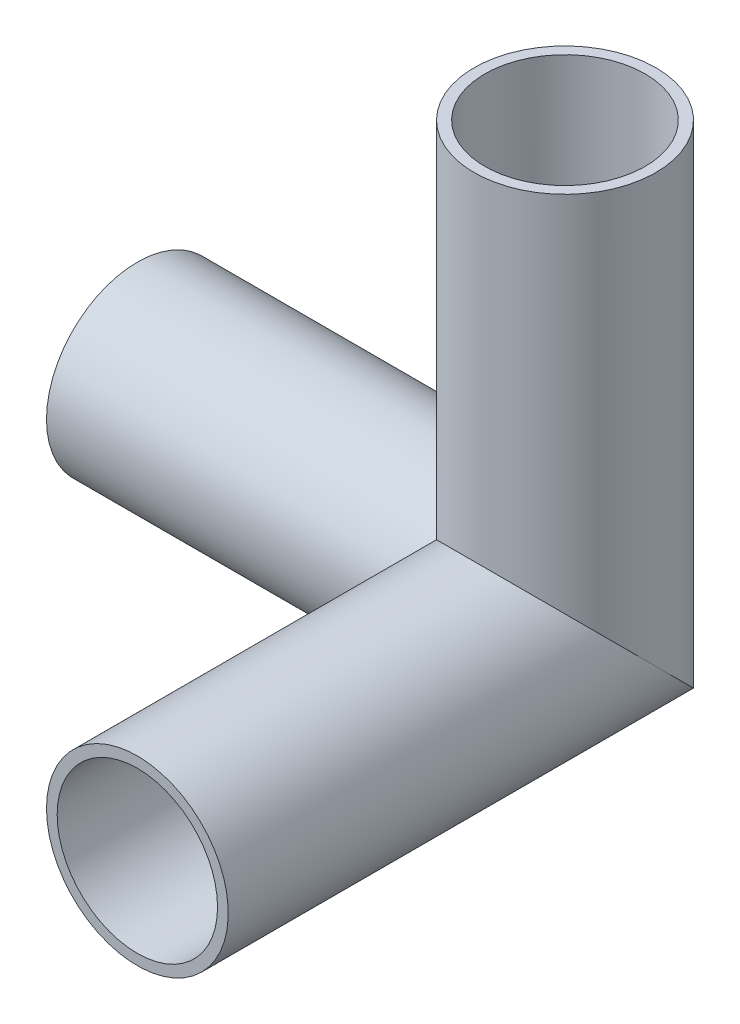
ISO-10303-21;
HEADER;
FILE_DESCRIPTION(('STEP AP214'),'2;1');
FILE_NAME('part.step','',(''),(''),'','','');
FILE_SCHEMA(('AUTOMOTIVE_DESIGN { 1 0 10303 214 1 1 1 1 }'));
ENDSEC;
DATA;
#1=APPLICATION_CONTEXT('core data for automotive mechanical design processes');
#2=APPLICATION_PROTOCOL_DEFINITION('international standard','automotive_design',2000,#1);
#3=PRODUCT_CONTEXT('',#1,'mechanical');
#4=PRODUCT('Part','Part','',(#3));
#5=PRODUCT_RELATED_PRODUCT_CATEGORY('part','',(#4));
#6=PRODUCT_DEFINITION_FORMATION('','',#4);
#7=PRODUCT_DEFINITION_CONTEXT('part definition',#1,'design');
#8=PRODUCT_DEFINITION('design','',#6,#7);
#9=PRODUCT_DEFINITION_SHAPE('','',#8);
#10=(LENGTH_UNIT() NAMED_UNIT(*) SI_UNIT(.MILLI.,.METRE.));
#11=(NAMED_UNIT(*) PLANE_ANGLE_UNIT() SI_UNIT($,.RADIAN.));
#12=(NAMED_UNIT(*) SI_UNIT($,.STERADIAN.) SOLID_ANGLE_UNIT());
#13=UNCERTAINTY_MEASURE_WITH_UNIT(LENGTH_MEASURE(1.E-05),#10,'distance_accuracy_value','');
#14=(GEOMETRIC_REPRESENTATION_CONTEXT(3) GLOBAL_UNCERTAINTY_ASSIGNED_CONTEXT((#13)) GLOBAL_UNIT_ASSIGNED_CONTEXT((#10,
#11,#12)) REPRESENTATION_CONTEXT('',''));
#15=CARTESIAN_POINT('',(0.,0.,0.));
#16=DIRECTION('',(0.,0.,1.));
#17=DIRECTION('',(1.,0.,0.));
#18=AXIS2_PLACEMENT_3D('',#15,#16,#17);
#19=CARTESIAN_POINT('',(0.,0.,-11.9745));
#20=DIRECTION('',(0.,0.,1.));
#21=DIRECTION('',(1.,0.,0.));
#22=AXIS2_PLACEMENT_3D('',#19,#20,#21);
#23=CYLINDRICAL_SURFACE('',#22,10.795);
#24=CARTESIAN_POINT('',(0.,0.,50.8));
#25=DIRECTION('',(0.,0.,-1.));
#26=DIRECTION('',(-1.,0.,0.));
#27=AXIS2_PLACEMENT_3D('',#24,#25,#26);
#28=CIRCLE('',#27,10.795);
#29=CARTESIAN_POINT('',(-10.795,0.,50.8));
#30=VERTEX_POINT('',#29);
#31=EDGE_CURVE('E111',#30,#30,#28,.T.);
#32=ORIENTED_EDGE('',*,*,#31,.T.);
#33=EDGE_LOOP('',(#32));
#34=FACE_BOUND('',#33,.T.);
#35=CARTESIAN_POINT('',(0.,0.,0.));
#36=DIRECTION('',(0.707106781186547,0.,0.707106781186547));
#37=DIRECTION('',(0.707106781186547,0.,-0.707106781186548));
#38=AXIS2_PLACEMENT_3D('',#35,#36,#37);
#39=ELLIPSE('',#38,15.2664354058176,10.795);
#40=CARTESIAN_POINT('',(-7.63321770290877,7.63321770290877,7.63321770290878));
#41=VERTEX_POINT('',#40);
#42=CARTESIAN_POINT('',(7.63321770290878,-7.63321770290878,-7.63321770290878));
#43=VERTEX_POINT('',#42);
#44=EDGE_CURVE('E49',#41,#43,#39,.T.);
#45=ORIENTED_EDGE('',*,*,#44,.T.);
#46=CARTESIAN_POINT('',(0.,0.,0.));
#47=DIRECTION('',(0.,-0.707106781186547,0.707106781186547));
#48=DIRECTION('',(0.,0.707106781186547,0.707106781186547));
#49=AXIS2_PLACEMENT_3D('',#46,#47,#48);
#50=ELLIPSE('',#49,15.2664354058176,10.795);
#51=EDGE_CURVE('E54',#41,#43,#50,.F.);
#52=ORIENTED_EDGE('',*,*,#51,.F.);
#53=EDGE_LOOP('',(#45,#52));
#54=FACE_BOUND('',#53,.T.);
#55=ADVANCED_FACE('F41',(#34,#54),#23,.T.);
#56=CARTESIAN_POINT('',(-50.8,0.,0.));
#57=DIRECTION('',(1.,0.,0.));
#58=DIRECTION('',(0.,0.,-1.));
#59=AXIS2_PLACEMENT_3D('',#56,#57,#58);
#60=CYLINDRICAL_SURFACE('',#59,10.795);
#61=CARTESIAN_POINT('',(-50.8,0.,0.));
#62=DIRECTION('',(-1.,0.,0.));
#63=DIRECTION('',(0.,0.,1.));
#64=AXIS2_PLACEMENT_3D('',#61,#62,#63);
#65=CIRCLE('',#64,10.795);
#66=CARTESIAN_POINT('',(-50.8,0.,10.795));
#67=VERTEX_POINT('',#66);
#68=EDGE_CURVE('E112',#67,#67,#65,.T.);
#69=ORIENTED_EDGE('',*,*,#68,.F.);
#70=EDGE_LOOP('',(#69));
#71=FACE_BOUND('',#70,.T.);
#72=CARTESIAN_POINT('',(0.,0.,0.));
#73=DIRECTION('',(0.707106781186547,0.707106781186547,0.));
#74=DIRECTION('',(0.707106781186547,-0.707106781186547,0.));
#75=AXIS2_PLACEMENT_3D('',#72,#73,#74);
#76=ELLIPSE('',#75,15.2664354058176,10.795);
#77=EDGE_CURVE('E11',#43,#41,#76,.T.);
#78=ORIENTED_EDGE('',*,*,#77,.F.);
#79=ORIENTED_EDGE('',*,*,#44,.F.);
#80=EDGE_LOOP('',(#78,#79));
#81=FACE_BOUND('',#80,.T.);
#82=ADVANCED_FACE('F122',(#71,#81),#60,.T.);
#83=CARTESIAN_POINT('',(0.,0.,50.8));
#84=DIRECTION('',(0.,0.,-1.));
#85=DIRECTION('',(-1.,0.,0.));
#86=AXIS2_PLACEMENT_3D('',#83,#84,#85);
#87=PLANE('',#86);
#88=CARTESIAN_POINT('',(0.,0.,50.8));
#89=DIRECTION('',(0.,0.,-1.));
#90=DIRECTION('',(-1.,0.,0.));
#91=AXIS2_PLACEMENT_3D('',#88,#89,#90);
#92=CIRCLE('',#91,9.525);
#93=CARTESIAN_POINT('',(-9.52499999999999,0.,50.8));
#94=VERTEX_POINT('',#93);
#95=EDGE_CURVE('E97',#94,#94,#92,.T.);
#96=ORIENTED_EDGE('',*,*,#95,.T.);
#97=EDGE_LOOP('',(#96));
#98=FACE_BOUND('',#97,.T.);
#99=ORIENTED_EDGE('',*,*,#31,.F.);
#100=EDGE_LOOP('',(#99));
#101=FACE_BOUND('',#100,.T.);
#102=ADVANCED_FACE('F119',(#98,#101),#87,.F.);
#103=CARTESIAN_POINT('',(-50.8,0.,0.));
#104=DIRECTION('',(-1.,0.,0.));
#105=DIRECTION('',(0.,0.,1.));
#106=AXIS2_PLACEMENT_3D('',#103,#104,#105);
#107=PLANE('',#106);
#108=CARTESIAN_POINT('',(-50.8,0.,0.));
#109=DIRECTION('',(-1.,0.,0.));
#110=DIRECTION('',(0.,0.,1.));
#111=AXIS2_PLACEMENT_3D('',#108,#109,#110);
#112=CIRCLE('',#111,9.525);
#113=CARTESIAN_POINT('',(-50.8,0.,9.525));
#114=VERTEX_POINT('',#113);
#115=EDGE_CURVE('E86',#114,#114,#112,.T.);
#116=ORIENTED_EDGE('',*,*,#115,.F.);
#117=EDGE_LOOP('',(#116));
#118=FACE_BOUND('',#117,.T.);
#119=ORIENTED_EDGE('',*,*,#68,.T.);
#120=EDGE_LOOP('',(#119));
#121=FACE_BOUND('',#120,.T.);
#122=ADVANCED_FACE('F121',(#118,#121),#107,.T.);
#123=CARTESIAN_POINT('',(0.,0.,0.));
#124=DIRECTION('',(0.,1.,0.));
#125=DIRECTION('',(0.,0.,1.));
#126=AXIS2_PLACEMENT_3D('',#123,#124,#125);
#127=CYLINDRICAL_SURFACE('',#126,10.795);
#128=ORIENTED_EDGE('',*,*,#51,.T.);
#129=ORIENTED_EDGE('',*,*,#77,.T.);
#130=EDGE_LOOP('',(#128,#129));
#131=FACE_BOUND('',#130,.T.);
#132=CARTESIAN_POINT('',(0.,50.8,0.));
#133=DIRECTION('',(0.,-1.,0.));
#134=DIRECTION('',(0.,0.,-1.));
#135=AXIS2_PLACEMENT_3D('',#132,#133,#134);
#136=CIRCLE('',#135,10.795);
#137=CARTESIAN_POINT('',(0.,50.8,-10.795));
#138=VERTEX_POINT('',#137);
#139=EDGE_CURVE('E98',#138,#138,#136,.T.);
#140=ORIENTED_EDGE('',*,*,#139,.T.);
#141=EDGE_LOOP('',(#140));
#142=FACE_BOUND('',#141,.T.);
#143=ADVANCED_FACE('F124',(#131,#142),#127,.T.);
#144=CARTESIAN_POINT('',(0.,50.8,0.));
#145=DIRECTION('',(0.,-1.,0.));
#146=DIRECTION('',(0.,0.,-1.));
#147=AXIS2_PLACEMENT_3D('',#144,#145,#146);
#148=PLANE('',#147);
#149=CARTESIAN_POINT('',(0.,50.8,0.));
#150=DIRECTION('',(0.,-1.,0.));
#151=DIRECTION('',(0.,0.,-1.));
#152=AXIS2_PLACEMENT_3D('',#149,#150,#151);
#153=CIRCLE('',#152,9.525);
#154=CARTESIAN_POINT('',(0.,50.8,-9.525));
#155=VERTEX_POINT('',#154);
#156=EDGE_CURVE('E100',#155,#155,#153,.T.);
#157=ORIENTED_EDGE('',*,*,#156,.T.);
#158=EDGE_LOOP('',(#157));
#159=FACE_BOUND('',#158,.T.);
#160=ORIENTED_EDGE('',*,*,#139,.F.);
#161=EDGE_LOOP('',(#160));
#162=FACE_BOUND('',#161,.T.);
#163=ADVANCED_FACE('F43',(#159,#162),#148,.F.);
#164=CARTESIAN_POINT('',(0.,0.,-11.9745));
#165=DIRECTION('',(0.,0.,1.));
#166=DIRECTION('',(1.,0.,0.));
#167=AXIS2_PLACEMENT_3D('',#164,#165,#166);
#168=CYLINDRICAL_SURFACE('',#167,9.525);
#169=ORIENTED_EDGE('',*,*,#95,.F.);
#170=EDGE_LOOP('',(#169));
#171=FACE_BOUND('',#170,.T.);
#172=CARTESIAN_POINT('',(0.,0.,0.));
#173=DIRECTION('',(0.707106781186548,0.,0.707106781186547));
#174=DIRECTION('',(0.707106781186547,0.,-0.707106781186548));
#175=AXIS2_PLACEMENT_3D('',#172,#173,#174);
#176=ELLIPSE('',#175,13.4703841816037,9.525);
#177=CARTESIAN_POINT('',(-6.73519209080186,6.73519209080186,6.73519209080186));
#178=VERTEX_POINT('',#177);
#179=CARTESIAN_POINT('',(0.,-9.525,0.));
#180=VERTEX_POINT('',#179);
#181=EDGE_CURVE('E81',#178,#180,#176,.T.);
#182=ORIENTED_EDGE('',*,*,#181,.F.);
#183=CARTESIAN_POINT('',(0.,0.,0.));
#184=DIRECTION('',(0.,-0.707106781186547,0.707106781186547));
#185=DIRECTION('',(0.,0.707106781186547,0.707106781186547));
#186=AXIS2_PLACEMENT_3D('',#183,#184,#185);
#187=ELLIPSE('',#186,13.4703841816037,9.525);
#188=CARTESIAN_POINT('',(9.525,0.,0.));
#189=VERTEX_POINT('',#188);
#190=EDGE_CURVE('E95',#178,#189,#187,.F.);
#191=ORIENTED_EDGE('',*,*,#190,.T.);
#192=CARTESIAN_POINT('',(0.,0.,0.));
#193=DIRECTION('',(0.,0.707106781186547,-0.707106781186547));
#194=DIRECTION('',(0.,0.707106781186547,0.707106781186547));
#195=AXIS2_PLACEMENT_3D('',#192,#193,#194);
#196=ELLIPSE('',#195,13.4703841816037,9.525);
#197=CARTESIAN_POINT('',(6.73519209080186,-6.73519209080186,-6.73519209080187));
#198=VERTEX_POINT('',#197);
#199=EDGE_CURVE('E82',#189,#198,#196,.T.);
#200=ORIENTED_EDGE('',*,*,#199,.T.);
#201=CARTESIAN_POINT('',(0.,0.,0.));
#202=DIRECTION('',(0.707106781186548,0.,0.707106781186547));
#203=DIRECTION('',(-0.707106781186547,0.,0.707106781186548));
#204=AXIS2_PLACEMENT_3D('',#201,#202,#203);
#205=ELLIPSE('',#204,13.4703841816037,9.525);
#206=EDGE_CURVE('E77',#180,#198,#205,.T.);
#207=ORIENTED_EDGE('',*,*,#206,.F.);
#208=EDGE_LOOP('',(#182,#191,#200,#207));
#209=FACE_BOUND('',#208,.T.);
#210=ADVANCED_FACE('F79',(#171,#209),#168,.F.);
#211=CARTESIAN_POINT('',(-50.8,0.,0.));
#212=DIRECTION('',(1.,0.,0.));
#213=DIRECTION('',(0.,0.,-1.));
#214=AXIS2_PLACEMENT_3D('',#211,#212,#213);
#215=CYLINDRICAL_SURFACE('',#214,9.525);
#216=ORIENTED_EDGE('',*,*,#115,.T.);
#217=EDGE_LOOP('',(#216));
#218=FACE_BOUND('',#217,.T.);
#219=CARTESIAN_POINT('',(0.,0.,0.));
#220=DIRECTION('',(0.707106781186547,0.707106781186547,0.));
#221=DIRECTION('',(-0.707106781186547,0.707106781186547,0.));
#222=AXIS2_PLACEMENT_3D('',#219,#220,#221);
#223=ELLIPSE('',#222,13.4703841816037,9.525);
#224=CARTESIAN_POINT('',(0.,0.,-9.525));
#225=VERTEX_POINT('',#224);
#226=EDGE_CURVE('E92',#198,#225,#223,.T.);
#227=ORIENTED_EDGE('',*,*,#226,.T.);
#228=CARTESIAN_POINT('',(0.,0.,0.));
#229=DIRECTION('',(0.707106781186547,0.707106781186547,0.));
#230=DIRECTION('',(0.707106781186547,-0.707106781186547,0.));
#231=AXIS2_PLACEMENT_3D('',#228,#229,#230);
#232=ELLIPSE('',#231,13.4703841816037,9.525);
#233=EDGE_CURVE('E89',#225,#178,#232,.T.);
#234=ORIENTED_EDGE('',*,*,#233,.T.);
#235=ORIENTED_EDGE('',*,*,#181,.T.);
#236=ORIENTED_EDGE('',*,*,#206,.T.);
#237=EDGE_LOOP('',(#227,#234,#235,#236));
#238=FACE_BOUND('',#237,.T.);
#239=ADVANCED_FACE('F88',(#218,#238),#215,.F.);
#240=CARTESIAN_POINT('',(0.,0.,0.));
#241=DIRECTION('',(0.,1.,0.));
#242=DIRECTION('',(0.,0.,1.));
#243=AXIS2_PLACEMENT_3D('',#240,#241,#242);
#244=CYLINDRICAL_SURFACE('',#243,9.525);
#245=ORIENTED_EDGE('',*,*,#190,.F.);
#246=ORIENTED_EDGE('',*,*,#233,.F.);
#247=ORIENTED_EDGE('',*,*,#226,.F.);
#248=ORIENTED_EDGE('',*,*,#199,.F.);
#249=EDGE_LOOP('',(#245,#246,#247,#248));
#250=FACE_BOUND('',#249,.T.);
#251=ORIENTED_EDGE('',*,*,#156,.F.);
#252=EDGE_LOOP('',(#251));
#253=FACE_BOUND('',#252,.T.);
#254=ADVANCED_FACE('F140',(#250,#253),#244,.F.);
#255=CLOSED_SHELL('',(#55,#82,#102,#122,#143,#163,#210,#239,#254));
#256=MANIFOLD_SOLID_BREP('B2',#255);
#257=ADVANCED_BREP_SHAPE_REPRESENTATION('',(#18,#256),#14);
#258=SHAPE_DEFINITION_REPRESENTATION(#9,#257);
ENDSEC;
END-ISO-10303-21;
